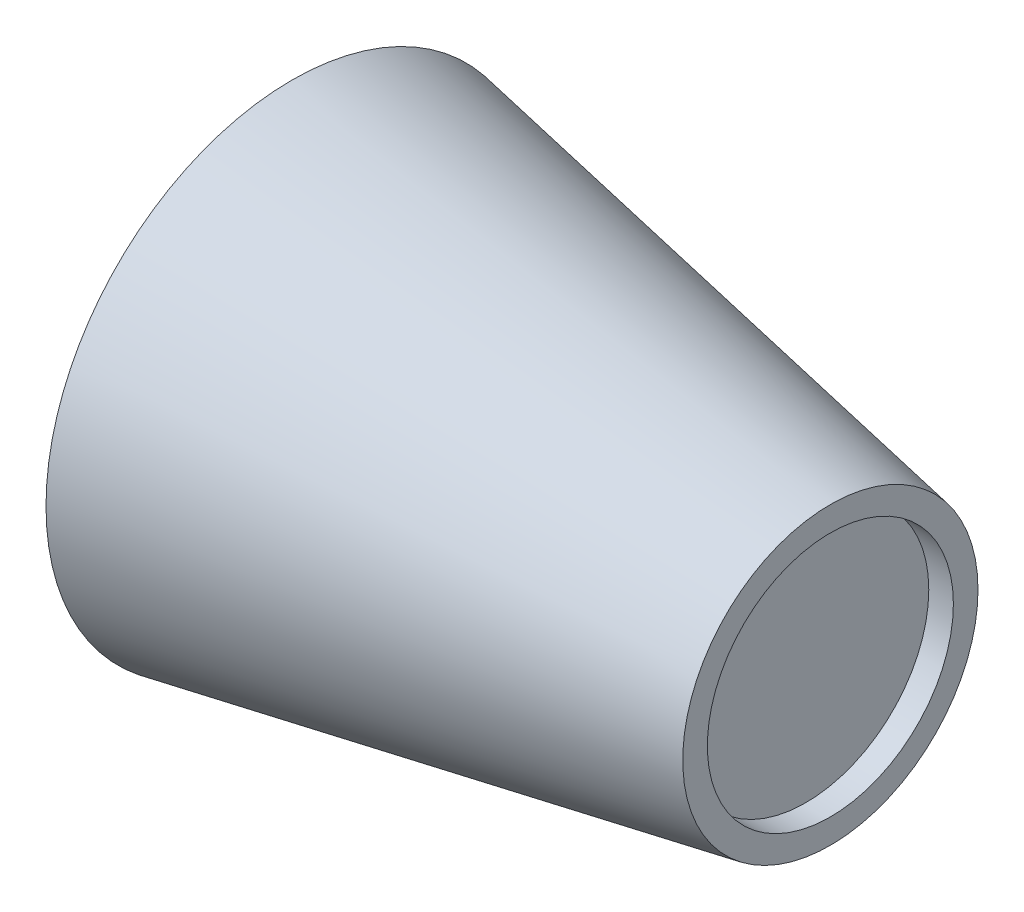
ISO-10303-21;
HEADER;
FILE_DESCRIPTION(('STEP AP214'),'2;1');
FILE_NAME('part.step','',(''),(''),'','','');
FILE_SCHEMA(('AUTOMOTIVE_DESIGN { 1 0 10303 214 1 1 1 1 }'));
ENDSEC;
DATA;
#1=APPLICATION_CONTEXT('core data for automotive mechanical design processes');
#2=APPLICATION_PROTOCOL_DEFINITION('international standard','automotive_design',2000,#1);
#3=PRODUCT_CONTEXT('',#1,'mechanical');
#4=PRODUCT('Part','Part','',(#3));
#5=PRODUCT_RELATED_PRODUCT_CATEGORY('part','',(#4));
#6=PRODUCT_DEFINITION_FORMATION('','',#4);
#7=PRODUCT_DEFINITION_CONTEXT('part definition',#1,'design');
#8=PRODUCT_DEFINITION('design','',#6,#7);
#9=PRODUCT_DEFINITION_SHAPE('','',#8);
#10=(LENGTH_UNIT() NAMED_UNIT(*) SI_UNIT(.MILLI.,.METRE.));
#11=(NAMED_UNIT(*) PLANE_ANGLE_UNIT() SI_UNIT($,.RADIAN.));
#12=(NAMED_UNIT(*) SI_UNIT($,.STERADIAN.) SOLID_ANGLE_UNIT());
#13=UNCERTAINTY_MEASURE_WITH_UNIT(LENGTH_MEASURE(1.E-05),#10,'distance_accuracy_value','');
#14=(GEOMETRIC_REPRESENTATION_CONTEXT(3) GLOBAL_UNCERTAINTY_ASSIGNED_CONTEXT((#13)) GLOBAL_UNIT_ASSIGNED_CONTEXT((#10,
#11,#12)) REPRESENTATION_CONTEXT('',''));
#15=CARTESIAN_POINT('',(0.,0.,0.));
#16=DIRECTION('',(0.,0.,1.));
#17=DIRECTION('',(1.,0.,0.));
#18=AXIS2_PLACEMENT_3D('',#15,#16,#17);
#19=CARTESIAN_POINT('',(15.88,0.,-29.8344571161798));
#20=DIRECTION('',(-1.,0.,0.));
#21=DIRECTION('',(0.,0.,1.));
#22=AXIS2_PLACEMENT_3D('',#19,#20,#21);
#23=PLANE('',#22);
#24=CARTESIAN_POINT('',(15.88,0.,-29.8344571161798));
#25=DIRECTION('',(1.,0.,0.));
#26=DIRECTION('',(0.,0.,-1.));
#27=AXIS2_PLACEMENT_3D('',#24,#25,#26);
#28=CIRCLE('',#27,3.175);
#29=CARTESIAN_POINT('',(15.88,0.,-33.0094571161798));
#30=VERTEX_POINT('',#29);
#31=EDGE_CURVE('E10',#30,#30,#28,.T.);
#32=ORIENTED_EDGE('',*,*,#31,.F.);
#33=EDGE_LOOP('',(#32));
#34=FACE_BOUND('',#33,.T.);
#35=ADVANCED_FACE('F28',(#34),#23,.T.);
#36=CARTESIAN_POINT('',(20.88,0.,-29.8344571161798));
#37=DIRECTION('',(1.,0.,0.));
#38=DIRECTION('',(0.,0.,-1.));
#39=AXIS2_PLACEMENT_3D('',#36,#37,#38);
#40=CYLINDRICAL_SURFACE('',#39,3.175);
#41=ORIENTED_EDGE('',*,*,#31,.T.);
#42=EDGE_LOOP('',(#41));
#43=FACE_BOUND('',#42,.T.);
#44=CARTESIAN_POINT('',(0.,0.,-29.8344571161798));
#45=DIRECTION('',(1.,0.,0.));
#46=DIRECTION('',(0.,0.,-1.));
#47=AXIS2_PLACEMENT_3D('',#44,#45,#46);
#48=CIRCLE('',#47,3.175);
#49=CARTESIAN_POINT('',(0.,0.,-33.0094571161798));
#50=VERTEX_POINT('',#49);
#51=EDGE_CURVE('E34',#50,#50,#48,.T.);
#52=ORIENTED_EDGE('',*,*,#51,.F.);
#53=EDGE_LOOP('',(#52));
#54=FACE_BOUND('',#53,.T.);
#55=ADVANCED_FACE('F70',(#43,#54),#40,.F.);
#56=CARTESIAN_POINT('',(0.,0.,-33.0094571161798));
#57=DIRECTION('',(-1.,0.,0.));
#58=DIRECTION('',(0.,0.,1.));
#59=AXIS2_PLACEMENT_3D('',#56,#57,#58);
#60=PLANE('',#59);
#61=ORIENTED_EDGE('',*,*,#51,.T.);
#62=EDGE_LOOP('',(#61));
#63=FACE_BOUND('',#62,.T.);
#64=CARTESIAN_POINT('',(0.,0.,-29.8344571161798));
#65=DIRECTION('',(1.,0.,0.));
#66=DIRECTION('',(0.,0.,-1.));
#67=AXIS2_PLACEMENT_3D('',#64,#65,#66);
#68=CIRCLE('',#67,10.);
#69=CARTESIAN_POINT('',(0.,0.,-39.8344571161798));
#70=VERTEX_POINT('',#69);
#71=EDGE_CURVE('E38',#70,#70,#68,.T.);
#72=ORIENTED_EDGE('',*,*,#71,.F.);
#73=EDGE_LOOP('',(#72));
#74=FACE_BOUND('',#73,.T.);
#75=ADVANCED_FACE('F75',(#63,#74),#60,.T.);
#76=CARTESIAN_POINT('',(21.88,0.,-29.8344571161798));
#77=DIRECTION('',(-1.,0.,0.));
#78=DIRECTION('',(0.,0.,1.));
#79=AXIS2_PLACEMENT_3D('',#76,#77,#78);
#80=CONICAL_SURFACE('',#79,6.,0.180818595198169);
#81=ORIENTED_EDGE('',*,*,#71,.T.);
#82=EDGE_LOOP('',(#81));
#83=FACE_BOUND('',#82,.T.);
#84=CARTESIAN_POINT('',(21.88,0.,-29.8344571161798));
#85=DIRECTION('',(1.,0.,0.));
#86=DIRECTION('',(0.,0.,-1.));
#87=AXIS2_PLACEMENT_3D('',#84,#85,#86);
#88=CIRCLE('',#87,6.);
#89=CARTESIAN_POINT('',(21.88,0.,-35.8344571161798));
#90=VERTEX_POINT('',#89);
#91=EDGE_CURVE('E42',#90,#90,#88,.T.);
#92=ORIENTED_EDGE('',*,*,#91,.F.);
#93=EDGE_LOOP('',(#92));
#94=FACE_BOUND('',#93,.T.);
#95=ADVANCED_FACE('F66',(#83,#94),#80,.T.);
#96=CARTESIAN_POINT('',(21.88,0.,-34.8344571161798));
#97=DIRECTION('',(1.,0.,0.));
#98=DIRECTION('',(0.,0.,-1.));
#99=AXIS2_PLACEMENT_3D('',#96,#97,#98);
#100=PLANE('',#99);
#101=ORIENTED_EDGE('',*,*,#91,.T.);
#102=EDGE_LOOP('',(#101));
#103=FACE_BOUND('',#102,.T.);
#104=CARTESIAN_POINT('',(21.88,0.,-29.8344571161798));
#105=DIRECTION('',(1.,0.,0.));
#106=DIRECTION('',(0.,0.,-1.));
#107=AXIS2_PLACEMENT_3D('',#104,#105,#106);
#108=CIRCLE('',#107,5.);
#109=CARTESIAN_POINT('',(21.88,0.,-34.8344571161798));
#110=VERTEX_POINT('',#109);
#111=EDGE_CURVE('E47',#110,#110,#108,.T.);
#112=ORIENTED_EDGE('',*,*,#111,.F.);
#113=EDGE_LOOP('',(#112));
#114=FACE_BOUND('',#113,.T.);
#115=ADVANCED_FACE('F58',(#103,#114),#100,.T.);
#116=CARTESIAN_POINT('',(20.88,0.,-29.8344571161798));
#117=DIRECTION('',(1.,0.,0.));
#118=DIRECTION('',(0.,0.,-1.));
#119=AXIS2_PLACEMENT_3D('',#116,#117,#118);
#120=CYLINDRICAL_SURFACE('',#119,5.);
#121=ORIENTED_EDGE('',*,*,#111,.T.);
#122=EDGE_LOOP('',(#121));
#123=FACE_BOUND('',#122,.T.);
#124=CARTESIAN_POINT('',(20.88,0.,-29.8344571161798));
#125=DIRECTION('',(1.,0.,0.));
#126=DIRECTION('',(0.,0.,-1.));
#127=AXIS2_PLACEMENT_3D('',#124,#125,#126);
#128=CIRCLE('',#127,5.);
#129=CARTESIAN_POINT('',(20.88,0.,-34.8344571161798));
#130=VERTEX_POINT('',#129);
#131=EDGE_CURVE('E50',#130,#130,#128,.T.);
#132=ORIENTED_EDGE('',*,*,#131,.F.);
#133=EDGE_LOOP('',(#132));
#134=FACE_BOUND('',#133,.T.);
#135=ADVANCED_FACE('F56',(#123,#134),#120,.F.);
#136=CARTESIAN_POINT('',(20.88,0.,-34.8344571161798));
#137=DIRECTION('',(1.,0.,0.));
#138=DIRECTION('',(0.,0.,-1.));
#139=AXIS2_PLACEMENT_3D('',#136,#137,#138);
#140=PLANE('',#139);
#141=ORIENTED_EDGE('',*,*,#131,.T.);
#142=EDGE_LOOP('',(#141));
#143=FACE_BOUND('',#142,.T.);
#144=ADVANCED_FACE('F54',(#143),#140,.T.);
#145=CLOSED_SHELL('',(#35,#55,#75,#95,#115,#135,#144));
#146=MANIFOLD_SOLID_BREP('B2',#145);
#147=ADVANCED_BREP_SHAPE_REPRESENTATION('',(#18,#146),#14);
#148=SHAPE_DEFINITION_REPRESENTATION(#9,#147);
ENDSEC;
END-ISO-10303-21;
